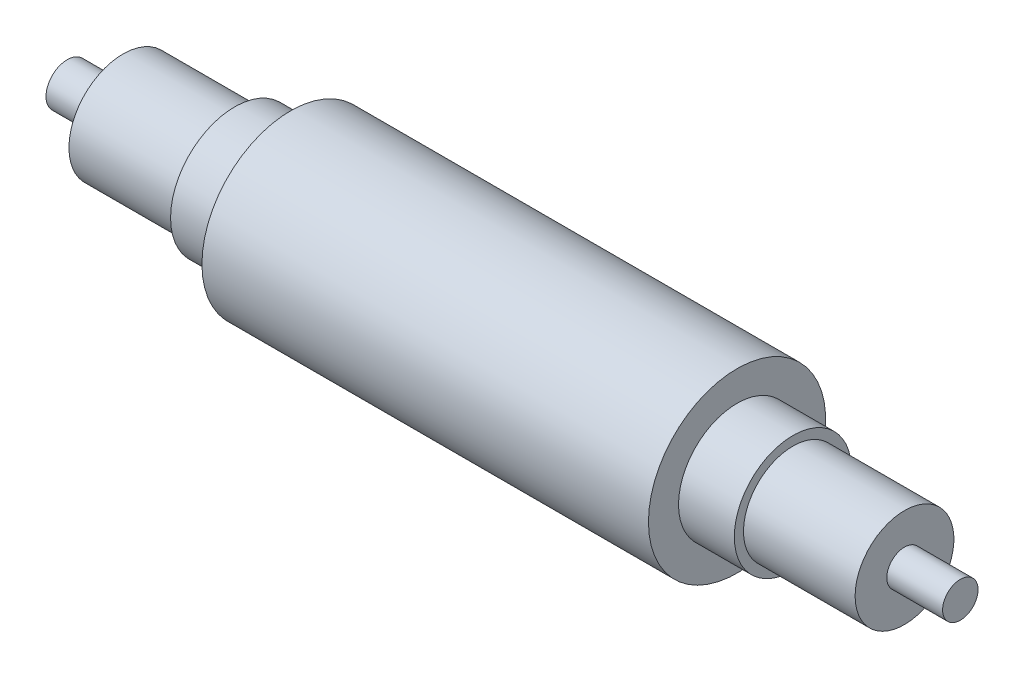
ISO-10303-21;
HEADER;
FILE_DESCRIPTION(('STEP AP214'),'2;1');
FILE_NAME('part.step','',(''),(''),'','','');
FILE_SCHEMA(('AUTOMOTIVE_DESIGN { 1 0 10303 214 1 1 1 1 }'));
ENDSEC;
DATA;
#1=APPLICATION_CONTEXT('core data for automotive mechanical design processes');
#2=APPLICATION_PROTOCOL_DEFINITION('international standard','automotive_design',2000,#1);
#3=PRODUCT_CONTEXT('',#1,'mechanical');
#4=PRODUCT('Part','Part','',(#3));
#5=PRODUCT_RELATED_PRODUCT_CATEGORY('part','',(#4));
#6=PRODUCT_DEFINITION_FORMATION('','',#4);
#7=PRODUCT_DEFINITION_CONTEXT('part definition',#1,'design');
#8=PRODUCT_DEFINITION('design','',#6,#7);
#9=PRODUCT_DEFINITION_SHAPE('','',#8);
#10=(LENGTH_UNIT() NAMED_UNIT(*) SI_UNIT(.MILLI.,.METRE.));
#11=(NAMED_UNIT(*) PLANE_ANGLE_UNIT() SI_UNIT($,.RADIAN.));
#12=(NAMED_UNIT(*) SI_UNIT($,.STERADIAN.) SOLID_ANGLE_UNIT());
#13=UNCERTAINTY_MEASURE_WITH_UNIT(LENGTH_MEASURE(1.E-05),#10,'distance_accuracy_value','');
#14=(GEOMETRIC_REPRESENTATION_CONTEXT(3) GLOBAL_UNCERTAINTY_ASSIGNED_CONTEXT((#13)) GLOBAL_UNIT_ASSIGNED_CONTEXT((#10,
#11,#12)) REPRESENTATION_CONTEXT('',''));
#15=CARTESIAN_POINT('',(0.,0.,0.));
#16=DIRECTION('',(0.,0.,1.));
#17=DIRECTION('',(1.,0.,0.));
#18=AXIS2_PLACEMENT_3D('',#15,#16,#17);
#19=CARTESIAN_POINT('',(-200.,0.,0.));
#20=DIRECTION('',(-1.,0.,0.));
#21=DIRECTION('',(0.,0.,1.));
#22=AXIS2_PLACEMENT_3D('',#19,#20,#21);
#23=PLANE('',#22);
#24=CARTESIAN_POINT('',(-200.,0.,0.));
#25=DIRECTION('',(-1.,0.,0.));
#26=DIRECTION('',(0.,0.,1.));
#27=AXIS2_PLACEMENT_3D('',#24,#25,#26);
#28=CIRCLE('',#27,9.525);
#29=CARTESIAN_POINT('',(-200.,0.,9.525));
#30=VERTEX_POINT('',#29);
#31=EDGE_CURVE('E11',#30,#30,#28,.T.);
#32=ORIENTED_EDGE('',*,*,#31,.T.);
#33=EDGE_LOOP('',(#32));
#34=FACE_BOUND('',#33,.T.);
#35=ADVANCED_FACE('F43',(#34),#23,.T.);
#36=CARTESIAN_POINT('',(-273.675289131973,0.,0.));
#37=DIRECTION('',(-1.,0.,0.));
#38=DIRECTION('',(0.,0.,1.));
#39=AXIS2_PLACEMENT_3D('',#36,#37,#38);
#40=CYLINDRICAL_SURFACE('',#39,9.525);
#41=ORIENTED_EDGE('',*,*,#31,.F.);
#42=EDGE_LOOP('',(#41));
#43=FACE_BOUND('',#42,.T.);
#44=CARTESIAN_POINT('',(-175.,0.,0.));
#45=DIRECTION('',(-1.,0.,0.));
#46=DIRECTION('',(0.,0.,1.));
#47=AXIS2_PLACEMENT_3D('',#44,#45,#46);
#48=CIRCLE('',#47,9.525);
#49=CARTESIAN_POINT('',(-175.,0.,9.525));
#50=VERTEX_POINT('',#49);
#51=EDGE_CURVE('E51',#50,#50,#48,.T.);
#52=ORIENTED_EDGE('',*,*,#51,.T.);
#53=EDGE_LOOP('',(#52));
#54=FACE_BOUND('',#53,.T.);
#55=ADVANCED_FACE('F121',(#43,#54),#40,.T.);
#56=CARTESIAN_POINT('',(-175.,0.,0.));
#57=DIRECTION('',(1.,0.,0.));
#58=DIRECTION('',(0.,0.,-1.));
#59=AXIS2_PLACEMENT_3D('',#56,#57,#58);
#60=PLANE('',#59);
#61=ORIENTED_EDGE('',*,*,#51,.F.);
#62=EDGE_LOOP('',(#61));
#63=FACE_BOUND('',#62,.T.);
#64=CARTESIAN_POINT('',(-175.,0.,0.));
#65=DIRECTION('',(-1.,0.,0.));
#66=DIRECTION('',(0.,0.,1.));
#67=AXIS2_PLACEMENT_3D('',#64,#65,#66);
#68=CIRCLE('',#67,24.245);
#69=CARTESIAN_POINT('',(-175.,0.,24.245));
#70=VERTEX_POINT('',#69);
#71=EDGE_CURVE('E56',#70,#70,#68,.T.);
#72=ORIENTED_EDGE('',*,*,#71,.T.);
#73=EDGE_LOOP('',(#72));
#74=FACE_BOUND('',#73,.T.);
#75=ADVANCED_FACE('F125',(#63,#74),#60,.F.);
#76=CARTESIAN_POINT('',(-273.675289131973,0.,0.));
#77=DIRECTION('',(-1.,0.,0.));
#78=DIRECTION('',(0.,0.,1.));
#79=AXIS2_PLACEMENT_3D('',#76,#77,#78);
#80=CYLINDRICAL_SURFACE('',#79,24.245);
#81=ORIENTED_EDGE('',*,*,#71,.F.);
#82=EDGE_LOOP('',(#81));
#83=FACE_BOUND('',#82,.T.);
#84=CARTESIAN_POINT('',(-125.,0.,0.));
#85=DIRECTION('',(-1.,0.,0.));
#86=DIRECTION('',(0.,0.,1.));
#87=AXIS2_PLACEMENT_3D('',#84,#85,#86);
#88=CIRCLE('',#87,24.245);
#89=CARTESIAN_POINT('',(-125.,0.,24.245));
#90=VERTEX_POINT('',#89);
#91=EDGE_CURVE('E61',#90,#90,#88,.T.);
#92=ORIENTED_EDGE('',*,*,#91,.T.);
#93=EDGE_LOOP('',(#92));
#94=FACE_BOUND('',#93,.T.);
#95=ADVANCED_FACE('F130',(#83,#94),#80,.T.);
#96=CARTESIAN_POINT('',(-125.,3.8678338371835E-13,0.));
#97=DIRECTION('',(1.,0.,0.));
#98=DIRECTION('',(0.,0.,-1.));
#99=AXIS2_PLACEMENT_3D('',#96,#97,#98);
#100=PLANE('',#99);
#101=ORIENTED_EDGE('',*,*,#91,.F.);
#102=EDGE_LOOP('',(#101));
#103=FACE_BOUND('',#102,.T.);
#104=CARTESIAN_POINT('',(-125.,0.,0.));
#105=DIRECTION('',(-1.,0.,0.));
#106=DIRECTION('',(0.,0.,1.));
#107=AXIS2_PLACEMENT_3D('',#104,#105,#106);
#108=CIRCLE('',#107,28.73);
#109=CARTESIAN_POINT('',(-125.,0.,28.73));
#110=VERTEX_POINT('',#109);
#111=EDGE_CURVE('E67',#110,#110,#108,.T.);
#112=ORIENTED_EDGE('',*,*,#111,.T.);
#113=EDGE_LOOP('',(#112));
#114=FACE_BOUND('',#113,.T.);
#115=ADVANCED_FACE('F136',(#103,#114),#100,.F.);
#116=CARTESIAN_POINT('',(-273.675289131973,0.,0.));
#117=DIRECTION('',(-1.,0.,0.));
#118=DIRECTION('',(0.,0.,1.));
#119=AXIS2_PLACEMENT_3D('',#116,#117,#118);
#120=CYLINDRICAL_SURFACE('',#119,28.73);
#121=ORIENTED_EDGE('',*,*,#111,.F.);
#122=EDGE_LOOP('',(#121));
#123=FACE_BOUND('',#122,.T.);
#124=CARTESIAN_POINT('',(-100.,0.,0.));
#125=DIRECTION('',(-1.,0.,0.));
#126=DIRECTION('',(0.,0.,1.));
#127=AXIS2_PLACEMENT_3D('',#124,#125,#126);
#128=CIRCLE('',#127,28.73);
#129=CARTESIAN_POINT('',(-100.,0.,28.73));
#130=VERTEX_POINT('',#129);
#131=EDGE_CURVE('E71',#130,#130,#128,.T.);
#132=ORIENTED_EDGE('',*,*,#131,.T.);
#133=EDGE_LOOP('',(#132));
#134=FACE_BOUND('',#133,.T.);
#135=ADVANCED_FACE('F140',(#123,#134),#120,.T.);
#136=CARTESIAN_POINT('',(-100.,0.,0.));
#137=DIRECTION('',(1.,0.,0.));
#138=DIRECTION('',(0.,0.,-1.));
#139=AXIS2_PLACEMENT_3D('',#136,#137,#138);
#140=PLANE('',#139);
#141=ORIENTED_EDGE('',*,*,#131,.F.);
#142=EDGE_LOOP('',(#141));
#143=FACE_BOUND('',#142,.T.);
#144=CARTESIAN_POINT('',(-100.,0.,0.));
#145=DIRECTION('',(-1.,0.,0.));
#146=DIRECTION('',(0.,0.,1.));
#147=AXIS2_PLACEMENT_3D('',#144,#145,#146);
#148=CIRCLE('',#147,39.6875);
#149=CARTESIAN_POINT('',(-100.,0.,39.6875));
#150=VERTEX_POINT('',#149);
#151=EDGE_CURVE('E75',#150,#150,#148,.T.);
#152=ORIENTED_EDGE('',*,*,#151,.T.);
#153=EDGE_LOOP('',(#152));
#154=FACE_BOUND('',#153,.T.);
#155=ADVANCED_FACE('F144',(#143,#154),#140,.F.);
#156=CARTESIAN_POINT('',(-273.675289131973,0.,0.));
#157=DIRECTION('',(-1.,0.,0.));
#158=DIRECTION('',(0.,0.,1.));
#159=AXIS2_PLACEMENT_3D('',#156,#157,#158);
#160=CYLINDRICAL_SURFACE('',#159,39.6875);
#161=ORIENTED_EDGE('',*,*,#151,.F.);
#162=EDGE_LOOP('',(#161));
#163=FACE_BOUND('',#162,.T.);
#164=CARTESIAN_POINT('',(100.,0.,0.));
#165=DIRECTION('',(-1.,0.,0.));
#166=DIRECTION('',(0.,0.,1.));
#167=AXIS2_PLACEMENT_3D('',#164,#165,#166);
#168=CIRCLE('',#167,39.6875);
#169=CARTESIAN_POINT('',(100.,0.,39.6875));
#170=VERTEX_POINT('',#169);
#171=EDGE_CURVE('E79',#170,#170,#168,.T.);
#172=ORIENTED_EDGE('',*,*,#171,.T.);
#173=EDGE_LOOP('',(#172));
#174=FACE_BOUND('',#173,.T.);
#175=ADVANCED_FACE('F148',(#163,#174),#160,.T.);
#176=CARTESIAN_POINT('',(100.,0.,0.));
#177=DIRECTION('',(-1.,0.,0.));
#178=DIRECTION('',(0.,0.,1.));
#179=AXIS2_PLACEMENT_3D('',#176,#177,#178);
#180=PLANE('',#179);
#181=ORIENTED_EDGE('',*,*,#171,.F.);
#182=EDGE_LOOP('',(#181));
#183=FACE_BOUND('',#182,.T.);
#184=CARTESIAN_POINT('',(100.,0.,0.));
#185=DIRECTION('',(-1.,0.,0.));
#186=DIRECTION('',(0.,0.,1.));
#187=AXIS2_PLACEMENT_3D('',#184,#185,#186);
#188=CIRCLE('',#187,26.22);
#189=CARTESIAN_POINT('',(100.,0.,26.22));
#190=VERTEX_POINT('',#189);
#191=EDGE_CURVE('E83',#190,#190,#188,.T.);
#192=ORIENTED_EDGE('',*,*,#191,.T.);
#193=EDGE_LOOP('',(#192));
#194=FACE_BOUND('',#193,.T.);
#195=ADVANCED_FACE('F152',(#183,#194),#180,.F.);
#196=CARTESIAN_POINT('',(-273.675289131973,0.,0.));
#197=DIRECTION('',(-1.,0.,0.));
#198=DIRECTION('',(0.,0.,1.));
#199=AXIS2_PLACEMENT_3D('',#196,#197,#198);
#200=CYLINDRICAL_SURFACE('',#199,26.22);
#201=ORIENTED_EDGE('',*,*,#191,.F.);
#202=EDGE_LOOP('',(#201));
#203=FACE_BOUND('',#202,.T.);
#204=CARTESIAN_POINT('',(125.,0.,0.));
#205=DIRECTION('',(-1.,0.,0.));
#206=DIRECTION('',(0.,0.,1.));
#207=AXIS2_PLACEMENT_3D('',#204,#205,#206);
#208=CIRCLE('',#207,26.22);
#209=CARTESIAN_POINT('',(125.,0.,26.22));
#210=VERTEX_POINT('',#209);
#211=EDGE_CURVE('E87',#210,#210,#208,.T.);
#212=ORIENTED_EDGE('',*,*,#211,.T.);
#213=EDGE_LOOP('',(#212));
#214=FACE_BOUND('',#213,.T.);
#215=ADVANCED_FACE('F156',(#203,#214),#200,.T.);
#216=CARTESIAN_POINT('',(125.,0.,0.));
#217=DIRECTION('',(-1.,0.,0.));
#218=DIRECTION('',(0.,0.,1.));
#219=AXIS2_PLACEMENT_3D('',#216,#217,#218);
#220=PLANE('',#219);
#221=ORIENTED_EDGE('',*,*,#211,.F.);
#222=EDGE_LOOP('',(#221));
#223=FACE_BOUND('',#222,.T.);
#224=CARTESIAN_POINT('',(125.,0.,0.));
#225=DIRECTION('',(-1.,0.,0.));
#226=DIRECTION('',(0.,0.,1.));
#227=AXIS2_PLACEMENT_3D('',#224,#225,#226);
#228=CIRCLE('',#227,22.12);
#229=CARTESIAN_POINT('',(125.,0.,22.12));
#230=VERTEX_POINT('',#229);
#231=EDGE_CURVE('E91',#230,#230,#228,.T.);
#232=ORIENTED_EDGE('',*,*,#231,.T.);
#233=EDGE_LOOP('',(#232));
#234=FACE_BOUND('',#233,.T.);
#235=ADVANCED_FACE('F160',(#223,#234),#220,.F.);
#236=CARTESIAN_POINT('',(-273.675289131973,0.,0.));
#237=DIRECTION('',(-1.,0.,0.));
#238=DIRECTION('',(0.,0.,1.));
#239=AXIS2_PLACEMENT_3D('',#236,#237,#238);
#240=CYLINDRICAL_SURFACE('',#239,22.12);
#241=ORIENTED_EDGE('',*,*,#231,.F.);
#242=EDGE_LOOP('',(#241));
#243=FACE_BOUND('',#242,.T.);
#244=CARTESIAN_POINT('',(175.,0.,0.));
#245=DIRECTION('',(-1.,0.,0.));
#246=DIRECTION('',(0.,0.,1.));
#247=AXIS2_PLACEMENT_3D('',#244,#245,#246);
#248=CIRCLE('',#247,22.12);
#249=CARTESIAN_POINT('',(175.,0.,22.12));
#250=VERTEX_POINT('',#249);
#251=EDGE_CURVE('E95',#250,#250,#248,.T.);
#252=ORIENTED_EDGE('',*,*,#251,.T.);
#253=EDGE_LOOP('',(#252));
#254=FACE_BOUND('',#253,.T.);
#255=ADVANCED_FACE('F164',(#243,#254),#240,.T.);
#256=CARTESIAN_POINT('',(175.,0.,0.));
#257=DIRECTION('',(-1.,0.,0.));
#258=DIRECTION('',(0.,0.,1.));
#259=AXIS2_PLACEMENT_3D('',#256,#257,#258);
#260=PLANE('',#259);
#261=ORIENTED_EDGE('',*,*,#251,.F.);
#262=EDGE_LOOP('',(#261));
#263=FACE_BOUND('',#262,.T.);
#264=CARTESIAN_POINT('',(175.,0.,0.));
#265=DIRECTION('',(-1.,0.,0.));
#266=DIRECTION('',(0.,0.,1.));
#267=AXIS2_PLACEMENT_3D('',#264,#265,#266);
#268=CIRCLE('',#267,7.9375);
#269=CARTESIAN_POINT('',(175.,0.,7.9375));
#270=VERTEX_POINT('',#269);
#271=EDGE_CURVE('E99',#270,#270,#268,.T.);
#272=ORIENTED_EDGE('',*,*,#271,.T.);
#273=EDGE_LOOP('',(#272));
#274=FACE_BOUND('',#273,.T.);
#275=ADVANCED_FACE('F117',(#263,#274),#260,.F.);
#276=CARTESIAN_POINT('',(-273.675289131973,0.,0.));
#277=DIRECTION('',(-1.,0.,0.));
#278=DIRECTION('',(0.,0.,1.));
#279=AXIS2_PLACEMENT_3D('',#276,#277,#278);
#280=CYLINDRICAL_SURFACE('',#279,7.9375);
#281=ORIENTED_EDGE('',*,*,#271,.F.);
#282=EDGE_LOOP('',(#281));
#283=FACE_BOUND('',#282,.T.);
#284=CARTESIAN_POINT('',(200.,0.,0.));
#285=DIRECTION('',(-1.,0.,0.));
#286=DIRECTION('',(0.,0.,1.));
#287=AXIS2_PLACEMENT_3D('',#284,#285,#286);
#288=CIRCLE('',#287,7.9375);
#289=CARTESIAN_POINT('',(200.,0.,7.9375));
#290=VERTEX_POINT('',#289);
#291=EDGE_CURVE('E103',#290,#290,#288,.T.);
#292=ORIENTED_EDGE('',*,*,#291,.T.);
#293=EDGE_LOOP('',(#292));
#294=FACE_BOUND('',#293,.T.);
#295=ADVANCED_FACE('F109',(#283,#294),#280,.T.);
#296=CARTESIAN_POINT('',(200.,0.,0.));
#297=DIRECTION('',(1.,0.,0.));
#298=DIRECTION('',(0.,0.,-1.));
#299=AXIS2_PLACEMENT_3D('',#296,#297,#298);
#300=PLANE('',#299);
#301=ORIENTED_EDGE('',*,*,#291,.F.);
#302=EDGE_LOOP('',(#301));
#303=FACE_BOUND('',#302,.T.);
#304=ADVANCED_FACE('F111',(#303),#300,.T.);
#305=CLOSED_SHELL('',(#35,#55,#75,#95,#115,#135,#155,#175,#195,#215,#235,#255,#275,#295,#304));
#306=MANIFOLD_SOLID_BREP('B2',#305);
#307=ADVANCED_BREP_SHAPE_REPRESENTATION('',(#18,#306),#14);
#308=SHAPE_DEFINITION_REPRESENTATION(#9,#307);
ENDSEC;
END-ISO-10303-21;
